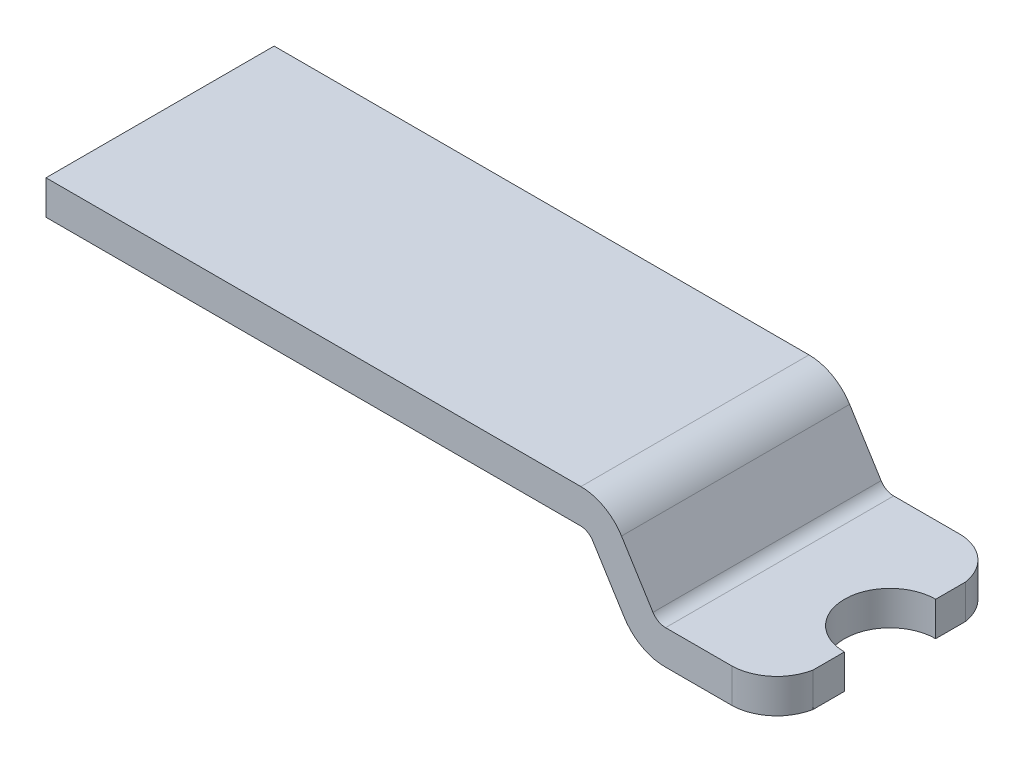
ISO-10303-21;
HEADER;
FILE_DESCRIPTION(('STEP AP214'),'2;1');
FILE_NAME('part.step','',(''),(''),'','','');
FILE_SCHEMA(('AUTOMOTIVE_DESIGN { 1 0 10303 214 1 1 1 1 }'));
ENDSEC;
DATA;
#1=APPLICATION_CONTEXT('core data for automotive mechanical design processes');
#2=APPLICATION_PROTOCOL_DEFINITION('international standard','automotive_design',2000,#1);
#3=PRODUCT_CONTEXT('',#1,'mechanical');
#4=PRODUCT('Part','Part','',(#3));
#5=PRODUCT_RELATED_PRODUCT_CATEGORY('part','',(#4));
#6=PRODUCT_DEFINITION_FORMATION('','',#4);
#7=PRODUCT_DEFINITION_CONTEXT('part definition',#1,'design');
#8=PRODUCT_DEFINITION('design','',#6,#7);
#9=PRODUCT_DEFINITION_SHAPE('','',#8);
#10=(LENGTH_UNIT() NAMED_UNIT(*) SI_UNIT(.MILLI.,.METRE.));
#11=(NAMED_UNIT(*) PLANE_ANGLE_UNIT() SI_UNIT($,.RADIAN.));
#12=(NAMED_UNIT(*) SI_UNIT($,.STERADIAN.) SOLID_ANGLE_UNIT());
#13=UNCERTAINTY_MEASURE_WITH_UNIT(LENGTH_MEASURE(1.E-05),#10,'distance_accuracy_value','');
#14=(GEOMETRIC_REPRESENTATION_CONTEXT(3) GLOBAL_UNCERTAINTY_ASSIGNED_CONTEXT((#13)) GLOBAL_UNIT_ASSIGNED_CONTEXT((#10,
#11,#12)) REPRESENTATION_CONTEXT('',''));
#15=CARTESIAN_POINT('',(0.,0.,0.));
#16=DIRECTION('',(0.,0.,1.));
#17=DIRECTION('',(1.,0.,0.));
#18=AXIS2_PLACEMENT_3D('',#15,#16,#17);
#19=CARTESIAN_POINT('',(2.3,0.,-8.));
#20=DIRECTION('',(0.,0.,1.));
#21=DIRECTION('',(1.,0.,0.));
#22=AXIS2_PLACEMENT_3D('',#19,#20,#21);
#23=PLANE('',#22);
#24=DIRECTION('',(-1.,0.,0.));
#25=VECTOR('',#24,1.);
#26=CARTESIAN_POINT('',(4.1,-0.1,-8.));
#27=LINE('',#26,#25);
#28=CARTESIAN_POINT('',(3.71335362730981,-0.1,-8.));
#29=VERTEX_POINT('',#28);
#30=CARTESIAN_POINT('',(3.12631708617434,-0.1,-8.));
#31=VERTEX_POINT('',#30);
#32=EDGE_CURVE('E39',#29,#31,#27,.T.);
#33=ORIENTED_EDGE('',*,*,#32,.F.);
#34=DIRECTION('',(0.,1.,0.));
#35=VECTOR('',#34,1.);
#36=CARTESIAN_POINT('',(3.7133536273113,-0.8,-8.));
#37=LINE('',#36,#35);
#38=CARTESIAN_POINT('',(3.7133536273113,0.2,-8.));
#39=VERTEX_POINT('',#38);
#40=EDGE_CURVE('E11',#29,#39,#37,.T.);
#41=ORIENTED_EDGE('',*,*,#40,.T.);
#42=DIRECTION('',(1.,0.,0.));
#43=VECTOR('',#42,1.);
#44=CARTESIAN_POINT('',(3.13186017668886,0.2,-8.));
#45=LINE('',#44,#43);
#46=CARTESIAN_POINT('',(3.13186017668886,0.2,-8.));
#47=VERTEX_POINT('',#46);
#48=EDGE_CURVE('E53',#47,#39,#45,.T.);
#49=ORIENTED_EDGE('',*,*,#48,.F.);
#50=CARTESIAN_POINT('',(3.13186017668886,0.33,-8.));
#51=DIRECTION('',(0.,0.,1.));
#52=DIRECTION('',(1.,0.,0.));
#53=AXIS2_PLACEMENT_3D('',#50,#51,#52);
#54=CIRCLE('',#53,0.13);
#55=CARTESIAN_POINT('',(3.02161392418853,0.261110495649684,-8.));
#56=VERTEX_POINT('',#55);
#57=EDGE_CURVE('E266',#56,#47,#54,.T.);
#58=ORIENTED_EDGE('',*,*,#57,.F.);
#59=DIRECTION('',(0.529919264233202,-0.848048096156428,0.));
#60=VECTOR('',#59,1.);
#61=CARTESIAN_POINT('',(2.74576185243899,0.702566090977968,-8.));
#62=LINE('',#61,#60);
#63=CARTESIAN_POINT('',(2.74576185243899,0.702566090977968,-8.));
#64=VERTEX_POINT('',#63);
#65=EDGE_CURVE('E228',#64,#56,#62,.T.);
#66=ORIENTED_EDGE('',*,*,#65,.F.);
#67=CARTESIAN_POINT('',(2.3895816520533,0.480000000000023,-8.));
#68=DIRECTION('',(0.,0.,-1.));
#69=DIRECTION('',(1.,0.,0.));
#70=AXIS2_PLACEMENT_3D('',#67,#68,#69);
#71=CIRCLE('',#70,0.42);
#72=CARTESIAN_POINT('',(2.3895816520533,0.900000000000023,-8.));
#73=VERTEX_POINT('',#72);
#74=EDGE_CURVE('E227',#73,#64,#71,.T.);
#75=ORIENTED_EDGE('',*,*,#74,.F.);
#76=DIRECTION('',(1.,0.,0.));
#77=VECTOR('',#76,1.);
#78=CARTESIAN_POINT('',(-2.3,0.900000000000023,-8.));
#79=LINE('',#78,#77);
#80=CARTESIAN_POINT('',(-2.3,0.900000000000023,-8.));
#81=VERTEX_POINT('',#80);
#82=EDGE_CURVE('E187',#81,#73,#79,.T.);
#83=ORIENTED_EDGE('',*,*,#82,.F.);
#84=DIRECTION('',(0.,1.,0.));
#85=VECTOR('',#84,1.);
#86=CARTESIAN_POINT('',(-2.3,0.900000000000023,-8.));
#87=LINE('',#86,#85);
#88=CARTESIAN_POINT('',(-2.3,0.600000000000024,-8.));
#89=VERTEX_POINT('',#88);
#90=EDGE_CURVE('E182',#89,#81,#87,.T.);
#91=ORIENTED_EDGE('',*,*,#90,.F.);
#92=DIRECTION('',(-1.,0.,0.));
#93=VECTOR('',#92,1.);
#94=CARTESIAN_POINT('',(-2.3,0.600000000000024,-8.));
#95=LINE('',#94,#93);
#96=CARTESIAN_POINT('',(2.38403856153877,0.600000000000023,-8.));
#97=VERTEX_POINT('',#96);
#98=EDGE_CURVE('E184',#97,#89,#95,.T.);
#99=ORIENTED_EDGE('',*,*,#98,.F.);
#100=CARTESIAN_POINT('',(2.38403856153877,0.470000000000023,-8.));
#101=DIRECTION('',(0.,0.,1.));
#102=DIRECTION('',(1.,0.,0.));
#103=AXIS2_PLACEMENT_3D('',#100,#101,#102);
#104=CIRCLE('',#103,0.13);
#105=CARTESIAN_POINT('',(2.4942848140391,0.538889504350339,-8.));
#106=VERTEX_POINT('',#105);
#107=EDGE_CURVE('E316',#106,#97,#104,.T.);
#108=ORIENTED_EDGE('',*,*,#107,.F.);
#109=DIRECTION('',(-0.529919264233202,0.848048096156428,0.));
#110=VECTOR('',#109,1.);
#111=CARTESIAN_POINT('',(2.77013688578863,0.0974339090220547,-8.));
#112=LINE('',#111,#110);
#113=CARTESIAN_POINT('',(2.77013688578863,0.0974339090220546,-8.));
#114=VERTEX_POINT('',#113);
#115=EDGE_CURVE('E256',#114,#106,#112,.T.);
#116=ORIENTED_EDGE('',*,*,#115,.F.);
#117=CARTESIAN_POINT('',(3.12631708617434,0.32,-8.));
#118=DIRECTION('',(0.,0.,-1.));
#119=DIRECTION('',(1.,0.,0.));
#120=AXIS2_PLACEMENT_3D('',#117,#118,#119);
#121=CIRCLE('',#120,0.42);
#122=EDGE_CURVE('E267',#31,#114,#121,.T.);
#123=ORIENTED_EDGE('',*,*,#122,.F.);
#124=EDGE_LOOP('',(#33,#41,#49,#58,#66,#75,#83,#91,#99,#108,#116,#123));
#125=FACE_BOUND('',#124,.T.);
#126=ADVANCED_FACE('F16',(#125),#23,.T.);
#127=CARTESIAN_POINT('',(2.38403856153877,0.470000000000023,-10.));
#128=DIRECTION('',(0.,0.,-1.));
#129=DIRECTION('',(0.,-1.,0.));
#130=AXIS2_PLACEMENT_3D('',#127,#128,#129);
#131=PLANE('',#130);
#132=DIRECTION('',(1.,0.,0.));
#133=VECTOR('',#132,1.);
#134=CARTESIAN_POINT('',(3.13186017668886,0.2,-10.));
#135=LINE('',#134,#133);
#136=CARTESIAN_POINT('',(3.13186017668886,0.2,-10.));
#137=VERTEX_POINT('',#136);
#138=CARTESIAN_POINT('',(3.72808084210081,0.2,-10.));
#139=VERTEX_POINT('',#138);
#140=EDGE_CURVE('E26',#137,#139,#135,.T.);
#141=ORIENTED_EDGE('',*,*,#140,.T.);
#142=DIRECTION('',(0.,1.,0.));
#143=VECTOR('',#142,1.);
#144=CARTESIAN_POINT('',(3.72808084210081,-0.8,-10.));
#145=LINE('',#144,#143);
#146=CARTESIAN_POINT('',(3.72808084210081,-0.1,-10.));
#147=VERTEX_POINT('',#146);
#148=EDGE_CURVE('E215',#147,#139,#145,.T.);
#149=ORIENTED_EDGE('',*,*,#148,.F.);
#150=DIRECTION('',(-1.,0.,0.));
#151=VECTOR('',#150,1.);
#152=CARTESIAN_POINT('',(4.1,-0.1,-10.));
#153=LINE('',#152,#151);
#154=CARTESIAN_POINT('',(3.12631708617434,-0.1,-10.));
#155=VERTEX_POINT('',#154);
#156=EDGE_CURVE('E330',#147,#155,#153,.T.);
#157=ORIENTED_EDGE('',*,*,#156,.T.);
#158=CARTESIAN_POINT('',(3.12631708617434,0.32,-10.));
#159=DIRECTION('',(0.,0.,-1.));
#160=DIRECTION('',(-1.,0.,0.));
#161=AXIS2_PLACEMENT_3D('',#158,#159,#160);
#162=CIRCLE('',#161,0.42);
#163=CARTESIAN_POINT('',(2.77013688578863,0.0974339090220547,-10.));
#164=VERTEX_POINT('',#163);
#165=EDGE_CURVE('E272',#155,#164,#162,.T.);
#166=ORIENTED_EDGE('',*,*,#165,.T.);
#167=DIRECTION('',(-0.529919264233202,0.848048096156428,0.));
#168=VECTOR('',#167,1.);
#169=CARTESIAN_POINT('',(2.77013688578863,0.0974339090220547,-10.));
#170=LINE('',#169,#168);
#171=CARTESIAN_POINT('',(2.4942848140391,0.538889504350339,-10.));
#172=VERTEX_POINT('',#171);
#173=EDGE_CURVE('E268',#164,#172,#170,.T.);
#174=ORIENTED_EDGE('',*,*,#173,.T.);
#175=CARTESIAN_POINT('',(2.38403856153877,0.470000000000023,-10.));
#176=DIRECTION('',(0.,0.,1.));
#177=DIRECTION('',(-1.,0.,0.));
#178=AXIS2_PLACEMENT_3D('',#175,#176,#177);
#179=CIRCLE('',#178,0.13);
#180=CARTESIAN_POINT('',(2.38403856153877,0.600000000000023,-10.));
#181=VERTEX_POINT('',#180);
#182=EDGE_CURVE('E273',#172,#181,#179,.T.);
#183=ORIENTED_EDGE('',*,*,#182,.T.);
#184=DIRECTION('',(-1.,0.,0.));
#185=VECTOR('',#184,1.);
#186=CARTESIAN_POINT('',(-2.3,0.600000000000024,-10.));
#187=LINE('',#186,#185);
#188=CARTESIAN_POINT('',(-2.3,0.600000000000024,-10.));
#189=VERTEX_POINT('',#188);
#190=EDGE_CURVE('E370',#181,#189,#187,.T.);
#191=ORIENTED_EDGE('',*,*,#190,.T.);
#192=DIRECTION('',(0.,1.,0.));
#193=VECTOR('',#192,1.);
#194=CARTESIAN_POINT('',(-2.3,0.900000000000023,-10.));
#195=LINE('',#194,#193);
#196=CARTESIAN_POINT('',(-2.3,0.900000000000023,-10.));
#197=VERTEX_POINT('',#196);
#198=EDGE_CURVE('E20',#189,#197,#195,.T.);
#199=ORIENTED_EDGE('',*,*,#198,.T.);
#200=DIRECTION('',(1.,0.,0.));
#201=VECTOR('',#200,1.);
#202=CARTESIAN_POINT('',(-2.3,0.900000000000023,-10.));
#203=LINE('',#202,#201);
#204=CARTESIAN_POINT('',(2.3895816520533,0.900000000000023,-10.));
#205=VERTEX_POINT('',#204);
#206=EDGE_CURVE('E312',#197,#205,#203,.T.);
#207=ORIENTED_EDGE('',*,*,#206,.T.);
#208=CARTESIAN_POINT('',(2.3895816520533,0.480000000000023,-10.));
#209=DIRECTION('',(0.,0.,-1.));
#210=DIRECTION('',(-1.,0.,0.));
#211=AXIS2_PLACEMENT_3D('',#208,#209,#210);
#212=CIRCLE('',#211,0.42);
#213=CARTESIAN_POINT('',(2.74576185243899,0.702566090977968,-10.));
#214=VERTEX_POINT('',#213);
#215=EDGE_CURVE('E359',#205,#214,#212,.T.);
#216=ORIENTED_EDGE('',*,*,#215,.T.);
#217=DIRECTION('',(0.529919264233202,-0.848048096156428,0.));
#218=VECTOR('',#217,1.);
#219=CARTESIAN_POINT('',(2.74576185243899,0.702566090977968,-10.));
#220=LINE('',#219,#218);
#221=CARTESIAN_POINT('',(3.02161392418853,0.261110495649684,-10.));
#222=VERTEX_POINT('',#221);
#223=EDGE_CURVE('E320',#214,#222,#220,.T.);
#224=ORIENTED_EDGE('',*,*,#223,.T.);
#225=CARTESIAN_POINT('',(3.13186017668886,0.33,-10.));
#226=DIRECTION('',(0.,0.,1.));
#227=DIRECTION('',(1.,0.,0.));
#228=AXIS2_PLACEMENT_3D('',#225,#226,#227);
#229=CIRCLE('',#228,0.13);
#230=EDGE_CURVE('E317',#222,#137,#229,.T.);
#231=ORIENTED_EDGE('',*,*,#230,.T.);
#232=EDGE_LOOP('',(#141,#149,#157,#166,#174,#183,#191,#199,#207,#216,#224,#231));
#233=FACE_BOUND('',#232,.T.);
#234=ADVANCED_FACE('F365',(#233),#131,.T.);
#235=CARTESIAN_POINT('',(3.13186017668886,0.2,-1.52234610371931));
#236=DIRECTION('',(0.,1.,0.));
#237=DIRECTION('',(1.,0.,0.));
#238=AXIS2_PLACEMENT_3D('',#235,#236,#237);
#239=PLANE('',#238);
#240=DIRECTION('',(0.,0.,-1.));
#241=VECTOR('',#240,1.);
#242=CARTESIAN_POINT('',(4.1,0.2,-1.52234610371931));
#243=LINE('',#242,#241);
#244=CARTESIAN_POINT('',(4.1,0.2,-9.4));
#245=VERTEX_POINT('',#244);
#246=CARTESIAN_POINT('',(4.1,0.2,-9.66238740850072));
#247=VERTEX_POINT('',#246);
#248=EDGE_CURVE('E321',#245,#247,#243,.T.);
#249=ORIENTED_EDGE('',*,*,#248,.T.);
#250=CARTESIAN_POINT('',(3.70478861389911,0.2,-9.60067873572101));
#251=DIRECTION('',(0.,1.,0.));
#252=DIRECTION('',(-1.,0.,0.));
#253=AXIS2_PLACEMENT_3D('',#250,#251,#252);
#254=CIRCLE('',#253,0.399999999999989);
#255=EDGE_CURVE('E334',#247,#139,#254,.T.);
#256=ORIENTED_EDGE('',*,*,#255,.T.);
#257=ORIENTED_EDGE('',*,*,#140,.F.);
#258=DIRECTION('',(0.,0.,-1.));
#259=VECTOR('',#258,1.);
#260=CARTESIAN_POINT('',(3.13186017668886,0.2,-1.52234610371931));
#261=LINE('',#260,#259);
#262=EDGE_CURVE('E262',#47,#137,#261,.T.);
#263=ORIENTED_EDGE('',*,*,#262,.F.);
#264=ORIENTED_EDGE('',*,*,#48,.T.);
#265=CARTESIAN_POINT('',(3.70683202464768,0.2,-8.39994683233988));
#266=DIRECTION('',(0.,1.,0.));
#267=DIRECTION('',(-1.,0.,0.));
#268=AXIS2_PLACEMENT_3D('',#265,#266,#267);
#269=CIRCLE('',#268,0.4);
#270=CARTESIAN_POINT('',(4.1,0.2,-8.32633336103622));
#271=VERTEX_POINT('',#270);
#272=EDGE_CURVE('E382',#39,#271,#269,.T.);
#273=ORIENTED_EDGE('',*,*,#272,.T.);
#274=DIRECTION('',(0.,0.,-1.));
#275=VECTOR('',#274,1.);
#276=CARTESIAN_POINT('',(4.1,0.2,-1.52234610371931));
#277=LINE('',#276,#275);
#278=CARTESIAN_POINT('',(4.1,0.2,-8.6));
#279=VERTEX_POINT('',#278);
#280=EDGE_CURVE('E280',#271,#279,#277,.T.);
#281=ORIENTED_EDGE('',*,*,#280,.T.);
#282=CARTESIAN_POINT('',(4.1,0.2,-9.));
#283=DIRECTION('',(0.,1.,0.));
#284=DIRECTION('',(-1.,0.,0.));
#285=AXIS2_PLACEMENT_3D('',#282,#283,#284);
#286=CIRCLE('',#285,0.4);
#287=EDGE_CURVE('E232',#245,#279,#286,.T.);
#288=ORIENTED_EDGE('',*,*,#287,.F.);
#289=EDGE_LOOP('',(#249,#256,#257,#263,#264,#273,#281,#288));
#290=FACE_BOUND('',#289,.T.);
#291=ADVANCED_FACE('F627',(#290),#239,.T.);
#292=CARTESIAN_POINT('',(4.1,0.2,-1.52234610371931));
#293=DIRECTION('',(1.,0.,0.));
#294=DIRECTION('',(0.,1.,0.));
#295=AXIS2_PLACEMENT_3D('',#292,#293,#294);
#296=PLANE('',#295);
#297=DIRECTION('',(0.,0.,-1.));
#298=VECTOR('',#297,1.);
#299=CARTESIAN_POINT('',(4.1,-0.1,-1.52234610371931));
#300=LINE('',#299,#298);
#301=CARTESIAN_POINT('',(4.1,-0.1,-9.4));
#302=VERTEX_POINT('',#301);
#303=CARTESIAN_POINT('',(4.1,-0.1,-9.66238740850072));
#304=VERTEX_POINT('',#303);
#305=EDGE_CURVE('E277',#302,#304,#300,.T.);
#306=ORIENTED_EDGE('',*,*,#305,.T.);
#307=DIRECTION('',(0.,1.,0.));
#308=VECTOR('',#307,1.);
#309=CARTESIAN_POINT('',(4.1,-0.8,-9.66238740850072));
#310=LINE('',#309,#308);
#311=EDGE_CURVE('E89',#304,#247,#310,.T.);
#312=ORIENTED_EDGE('',*,*,#311,.T.);
#313=ORIENTED_EDGE('',*,*,#248,.F.);
#314=DIRECTION('',(0.,1.,0.));
#315=VECTOR('',#314,1.);
#316=CARTESIAN_POINT('',(4.1,-0.8,-9.4));
#317=LINE('',#316,#315);
#318=EDGE_CURVE('E105',#302,#245,#317,.T.);
#319=ORIENTED_EDGE('',*,*,#318,.F.);
#320=EDGE_LOOP('',(#306,#312,#313,#319));
#321=FACE_BOUND('',#320,.T.);
#322=ADVANCED_FACE('F621',(#321),#296,.T.);
#323=CARTESIAN_POINT('',(4.1,0.2,-1.52234610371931));
#324=DIRECTION('',(1.,0.,0.));
#325=DIRECTION('',(0.,1.,0.));
#326=AXIS2_PLACEMENT_3D('',#323,#324,#325);
#327=PLANE('',#326);
#328=ORIENTED_EDGE('',*,*,#280,.F.);
#329=DIRECTION('',(0.,1.,0.));
#330=VECTOR('',#329,1.);
#331=CARTESIAN_POINT('',(4.1,-0.8,-8.32633336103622));
#332=LINE('',#331,#330);
#333=CARTESIAN_POINT('',(4.1,-0.1,-8.32633336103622));
#334=VERTEX_POINT('',#333);
#335=EDGE_CURVE('E218',#334,#271,#332,.T.);
#336=ORIENTED_EDGE('',*,*,#335,.F.);
#337=DIRECTION('',(0.,0.,-1.));
#338=VECTOR('',#337,1.);
#339=CARTESIAN_POINT('',(4.1,-0.1,-1.52234610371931));
#340=LINE('',#339,#338);
#341=CARTESIAN_POINT('',(4.1,-0.1,-8.6));
#342=VERTEX_POINT('',#341);
#343=EDGE_CURVE('E219',#334,#342,#340,.T.);
#344=ORIENTED_EDGE('',*,*,#343,.T.);
#345=DIRECTION('',(0.,1.,0.));
#346=VECTOR('',#345,1.);
#347=CARTESIAN_POINT('',(4.1,-0.8,-8.6));
#348=LINE('',#347,#346);
#349=EDGE_CURVE('E223',#342,#279,#348,.T.);
#350=ORIENTED_EDGE('',*,*,#349,.T.);
#351=EDGE_LOOP('',(#328,#336,#344,#350));
#352=FACE_BOUND('',#351,.T.);
#353=ADVANCED_FACE('F626',(#352),#327,.T.);
#354=CARTESIAN_POINT('',(4.1,-0.1,-1.52234610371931));
#355=DIRECTION('',(0.,-1.,0.));
#356=DIRECTION('',(0.,0.,-1.));
#357=AXIS2_PLACEMENT_3D('',#354,#355,#356);
#358=PLANE('',#357);
#359=ORIENTED_EDGE('',*,*,#156,.F.);
#360=CARTESIAN_POINT('',(3.70478861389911,-0.1,-9.60067873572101));
#361=DIRECTION('',(0.,-1.,0.));
#362=DIRECTION('',(0.,0.,-1.));
#363=AXIS2_PLACEMENT_3D('',#360,#361,#362);
#364=CIRCLE('',#363,0.399999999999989);
#365=EDGE_CURVE('E281',#147,#304,#364,.T.);
#366=ORIENTED_EDGE('',*,*,#365,.T.);
#367=ORIENTED_EDGE('',*,*,#305,.F.);
#368=CARTESIAN_POINT('',(4.1,-0.1,-9.));
#369=DIRECTION('',(0.,-1.,0.));
#370=DIRECTION('',(0.,0.,-1.));
#371=AXIS2_PLACEMENT_3D('',#368,#369,#370);
#372=CIRCLE('',#371,0.4);
#373=EDGE_CURVE('E229',#342,#302,#372,.T.);
#374=ORIENTED_EDGE('',*,*,#373,.F.);
#375=ORIENTED_EDGE('',*,*,#343,.F.);
#376=CARTESIAN_POINT('',(3.70683202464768,-0.1,-8.39994683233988));
#377=DIRECTION('',(0.,-1.,0.));
#378=DIRECTION('',(0.,0.,-1.));
#379=AXIS2_PLACEMENT_3D('',#376,#377,#378);
#380=CIRCLE('',#379,0.400000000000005);
#381=EDGE_CURVE('E285',#334,#29,#380,.T.);
#382=ORIENTED_EDGE('',*,*,#381,.T.);
#383=ORIENTED_EDGE('',*,*,#32,.T.);
#384=DIRECTION('',(0.,0.,-1.));
#385=VECTOR('',#384,1.);
#386=CARTESIAN_POINT('',(3.12631708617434,-0.1,-1.52234610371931));
#387=LINE('',#386,#385);
#388=EDGE_CURVE('E286',#31,#155,#387,.T.);
#389=ORIENTED_EDGE('',*,*,#388,.T.);
#390=EDGE_LOOP('',(#359,#366,#367,#374,#375,#382,#383,#389));
#391=FACE_BOUND('',#390,.T.);
#392=ADVANCED_FACE('F18',(#391),#358,.T.);
#393=CARTESIAN_POINT('',(-2.3,0.900000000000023,-1.52234610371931));
#394=DIRECTION('',(0.,1.,0.));
#395=DIRECTION('',(1.,0.,0.));
#396=AXIS2_PLACEMENT_3D('',#393,#394,#395);
#397=PLANE('',#396);
#398=DIRECTION('',(0.,0.,-1.));
#399=VECTOR('',#398,1.);
#400=CARTESIAN_POINT('',(-2.3,0.900000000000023,-1.52234610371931));
#401=LINE('',#400,#399);
#402=EDGE_CURVE('E194',#81,#197,#401,.T.);
#403=ORIENTED_EDGE('',*,*,#402,.F.);
#404=ORIENTED_EDGE('',*,*,#82,.T.);
#405=DIRECTION('',(0.,0.,-1.));
#406=VECTOR('',#405,1.);
#407=CARTESIAN_POINT('',(2.3895816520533,0.900000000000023,-1.52234610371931));
#408=LINE('',#407,#406);
#409=EDGE_CURVE('E255',#73,#205,#408,.T.);
#410=ORIENTED_EDGE('',*,*,#409,.T.);
#411=ORIENTED_EDGE('',*,*,#206,.F.);
#412=EDGE_LOOP('',(#403,#404,#410,#411));
#413=FACE_BOUND('',#412,.T.);
#414=ADVANCED_FACE('F354',(#413),#397,.T.);
#415=CARTESIAN_POINT('',(2.3895816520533,0.480000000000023,-1.52234610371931));
#416=DIRECTION('',(0.,0.,-1.));
#417=DIRECTION('',(-1.,0.,0.));
#418=AXIS2_PLACEMENT_3D('',#415,#416,#417);
#419=CYLINDRICAL_SURFACE('',#418,0.42);
#420=ORIENTED_EDGE('',*,*,#409,.F.);
#421=ORIENTED_EDGE('',*,*,#74,.T.);
#422=DIRECTION('',(0.,0.,-1.));
#423=VECTOR('',#422,1.);
#424=CARTESIAN_POINT('',(2.74576185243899,0.702566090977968,-1.52234610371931));
#425=LINE('',#424,#423);
#426=EDGE_CURVE('E224',#64,#214,#425,.T.);
#427=ORIENTED_EDGE('',*,*,#426,.T.);
#428=ORIENTED_EDGE('',*,*,#215,.F.);
#429=EDGE_LOOP('',(#420,#421,#427,#428));
#430=FACE_BOUND('',#429,.T.);
#431=ADVANCED_FACE('F357',(#430),#419,.T.);
#432=CARTESIAN_POINT('',(2.74576185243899,0.702566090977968,-1.52234610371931));
#433=DIRECTION('',(0.848048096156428,0.529919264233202,0.));
#434=DIRECTION('',(0.,0.,-1.));
#435=AXIS2_PLACEMENT_3D('',#432,#433,#434);
#436=PLANE('',#435);
#437=ORIENTED_EDGE('',*,*,#426,.F.);
#438=ORIENTED_EDGE('',*,*,#65,.T.);
#439=DIRECTION('',(0.,0.,-1.));
#440=VECTOR('',#439,1.);
#441=CARTESIAN_POINT('',(3.02161392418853,0.261110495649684,-1.52234610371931));
#442=LINE('',#441,#440);
#443=EDGE_CURVE('E295',#56,#222,#442,.T.);
#444=ORIENTED_EDGE('',*,*,#443,.T.);
#445=ORIENTED_EDGE('',*,*,#223,.F.);
#446=EDGE_LOOP('',(#437,#438,#444,#445));
#447=FACE_BOUND('',#446,.T.);
#448=ADVANCED_FACE('F606',(#447),#436,.T.);
#449=CARTESIAN_POINT('',(3.13186017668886,0.33,-1.52234610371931));
#450=DIRECTION('',(0.,0.,-1.));
#451=DIRECTION('',(-1.,0.,0.));
#452=AXIS2_PLACEMENT_3D('',#449,#450,#451);
#453=CYLINDRICAL_SURFACE('',#452,0.13);
#454=ORIENTED_EDGE('',*,*,#443,.F.);
#455=ORIENTED_EDGE('',*,*,#57,.T.);
#456=ORIENTED_EDGE('',*,*,#262,.T.);
#457=ORIENTED_EDGE('',*,*,#230,.F.);
#458=EDGE_LOOP('',(#454,#455,#456,#457));
#459=FACE_BOUND('',#458,.T.);
#460=ADVANCED_FACE('F611',(#459),#453,.F.);
#461=CARTESIAN_POINT('',(3.12631708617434,0.32,-1.52234610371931));
#462=DIRECTION('',(0.,0.,-1.));
#463=DIRECTION('',(-1.,0.,0.));
#464=AXIS2_PLACEMENT_3D('',#461,#462,#463);
#465=CYLINDRICAL_SURFACE('',#464,0.42);
#466=ORIENTED_EDGE('',*,*,#388,.F.);
#467=ORIENTED_EDGE('',*,*,#122,.T.);
#468=DIRECTION('',(0.,0.,-1.));
#469=VECTOR('',#468,1.);
#470=CARTESIAN_POINT('',(2.77013688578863,0.0974339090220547,-1.52234610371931));
#471=LINE('',#470,#469);
#472=EDGE_CURVE('E260',#114,#164,#471,.T.);
#473=ORIENTED_EDGE('',*,*,#472,.T.);
#474=ORIENTED_EDGE('',*,*,#165,.F.);
#475=EDGE_LOOP('',(#466,#467,#473,#474));
#476=FACE_BOUND('',#475,.T.);
#477=ADVANCED_FACE('F667',(#476),#465,.T.);
#478=CARTESIAN_POINT('',(2.77013688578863,0.0974339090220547,-1.52234610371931));
#479=DIRECTION('',(-0.848048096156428,-0.529919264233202,0.));
#480=DIRECTION('',(-0.529919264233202,0.848048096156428,0.));
#481=AXIS2_PLACEMENT_3D('',#478,#479,#480);
#482=PLANE('',#481);
#483=ORIENTED_EDGE('',*,*,#472,.F.);
#484=ORIENTED_EDGE('',*,*,#115,.T.);
#485=DIRECTION('',(0.,0.,-1.));
#486=VECTOR('',#485,1.);
#487=CARTESIAN_POINT('',(2.4942848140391,0.538889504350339,-1.52234610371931));
#488=LINE('',#487,#486);
#489=EDGE_CURVE('E261',#106,#172,#488,.T.);
#490=ORIENTED_EDGE('',*,*,#489,.T.);
#491=ORIENTED_EDGE('',*,*,#173,.F.);
#492=EDGE_LOOP('',(#483,#484,#490,#491));
#493=FACE_BOUND('',#492,.T.);
#494=ADVANCED_FACE('F661',(#493),#482,.T.);
#495=CARTESIAN_POINT('',(2.38403856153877,0.470000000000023,-1.52234610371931));
#496=DIRECTION('',(0.,0.,-1.));
#497=DIRECTION('',(-1.,0.,0.));
#498=AXIS2_PLACEMENT_3D('',#495,#496,#497);
#499=CYLINDRICAL_SURFACE('',#498,0.13);
#500=ORIENTED_EDGE('',*,*,#489,.F.);
#501=ORIENTED_EDGE('',*,*,#107,.T.);
#502=DIRECTION('',(0.,0.,-1.));
#503=VECTOR('',#502,1.);
#504=CARTESIAN_POINT('',(2.38403856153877,0.600000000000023,-1.52234610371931));
#505=LINE('',#504,#503);
#506=EDGE_CURVE('E201',#97,#181,#505,.T.);
#507=ORIENTED_EDGE('',*,*,#506,.T.);
#508=ORIENTED_EDGE('',*,*,#182,.F.);
#509=EDGE_LOOP('',(#500,#501,#507,#508));
#510=FACE_BOUND('',#509,.T.);
#511=ADVANCED_FACE('F666',(#510),#499,.F.);
#512=CARTESIAN_POINT('',(-2.3,0.600000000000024,-1.52234610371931));
#513=DIRECTION('',(0.,-1.,0.));
#514=DIRECTION('',(-1.,0.,0.));
#515=AXIS2_PLACEMENT_3D('',#512,#513,#514);
#516=PLANE('',#515);
#517=ORIENTED_EDGE('',*,*,#506,.F.);
#518=ORIENTED_EDGE('',*,*,#98,.T.);
#519=DIRECTION('',(0.,0.,-1.));
#520=VECTOR('',#519,1.);
#521=CARTESIAN_POINT('',(-2.3,0.600000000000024,-1.52234610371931));
#522=LINE('',#521,#520);
#523=EDGE_CURVE('E193',#89,#189,#522,.T.);
#524=ORIENTED_EDGE('',*,*,#523,.T.);
#525=ORIENTED_EDGE('',*,*,#190,.F.);
#526=EDGE_LOOP('',(#517,#518,#524,#525));
#527=FACE_BOUND('',#526,.T.);
#528=ADVANCED_FACE('F199',(#527),#516,.T.);
#529=CARTESIAN_POINT('',(-2.3,0.900000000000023,-1.52234610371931));
#530=DIRECTION('',(-1.,0.,0.));
#531=DIRECTION('',(0.,0.,1.));
#532=AXIS2_PLACEMENT_3D('',#529,#530,#531);
#533=PLANE('',#532);
#534=ORIENTED_EDGE('',*,*,#523,.F.);
#535=ORIENTED_EDGE('',*,*,#90,.T.);
#536=ORIENTED_EDGE('',*,*,#402,.T.);
#537=ORIENTED_EDGE('',*,*,#198,.F.);
#538=EDGE_LOOP('',(#534,#535,#536,#537));
#539=FACE_BOUND('',#538,.T.);
#540=ADVANCED_FACE('F204',(#539),#533,.T.);
#541=CARTESIAN_POINT('',(4.1,-0.8,-9.));
#542=DIRECTION('',(0.,1.,0.));
#543=DIRECTION('',(0.,0.,1.));
#544=AXIS2_PLACEMENT_3D('',#541,#542,#543);
#545=CYLINDRICAL_SURFACE('',#544,0.4);
#546=ORIENTED_EDGE('',*,*,#287,.T.);
#547=ORIENTED_EDGE('',*,*,#349,.F.);
#548=ORIENTED_EDGE('',*,*,#373,.T.);
#549=ORIENTED_EDGE('',*,*,#318,.T.);
#550=EDGE_LOOP('',(#546,#547,#548,#549));
#551=FACE_BOUND('',#550,.T.);
#552=ADVANCED_FACE('F647',(#551),#545,.F.);
#553=CARTESIAN_POINT('',(3.70683202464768,-0.8,-8.39994683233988));
#554=DIRECTION('',(0.,1.,0.));
#555=DIRECTION('',(0.,0.,1.));
#556=AXIS2_PLACEMENT_3D('',#553,#554,#555);
#557=CYLINDRICAL_SURFACE('',#556,0.400000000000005);
#558=ORIENTED_EDGE('',*,*,#40,.F.);
#559=ORIENTED_EDGE('',*,*,#381,.F.);
#560=ORIENTED_EDGE('',*,*,#335,.T.);
#561=ORIENTED_EDGE('',*,*,#272,.F.);
#562=EDGE_LOOP('',(#558,#559,#560,#561));
#563=FACE_BOUND('',#562,.T.);
#564=ADVANCED_FACE('F652',(#563),#557,.T.);
#565=CARTESIAN_POINT('',(3.70478861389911,-0.8,-9.60067873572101));
#566=DIRECTION('',(0.,1.,0.));
#567=DIRECTION('',(0.,0.,1.));
#568=AXIS2_PLACEMENT_3D('',#565,#566,#567);
#569=CYLINDRICAL_SURFACE('',#568,0.399999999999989);
#570=ORIENTED_EDGE('',*,*,#311,.F.);
#571=ORIENTED_EDGE('',*,*,#365,.F.);
#572=ORIENTED_EDGE('',*,*,#148,.T.);
#573=ORIENTED_EDGE('',*,*,#255,.F.);
#574=EDGE_LOOP('',(#570,#571,#572,#573));
#575=FACE_BOUND('',#574,.T.);
#576=ADVANCED_FACE('F700',(#575),#569,.T.);
#577=CLOSED_SHELL('',(#126,#234,#291,#322,#353,#392,#414,#431,#448,#460,#477,#494,#511,#528,
#540,#552,#564,#576));
#578=MANIFOLD_SOLID_BREP('B1',#577);
#579=ADVANCED_BREP_SHAPE_REPRESENTATION('',(#18,#578),#14);
#580=SHAPE_DEFINITION_REPRESENTATION(#9,#579);
ENDSEC;
END-ISO-10303-21;
